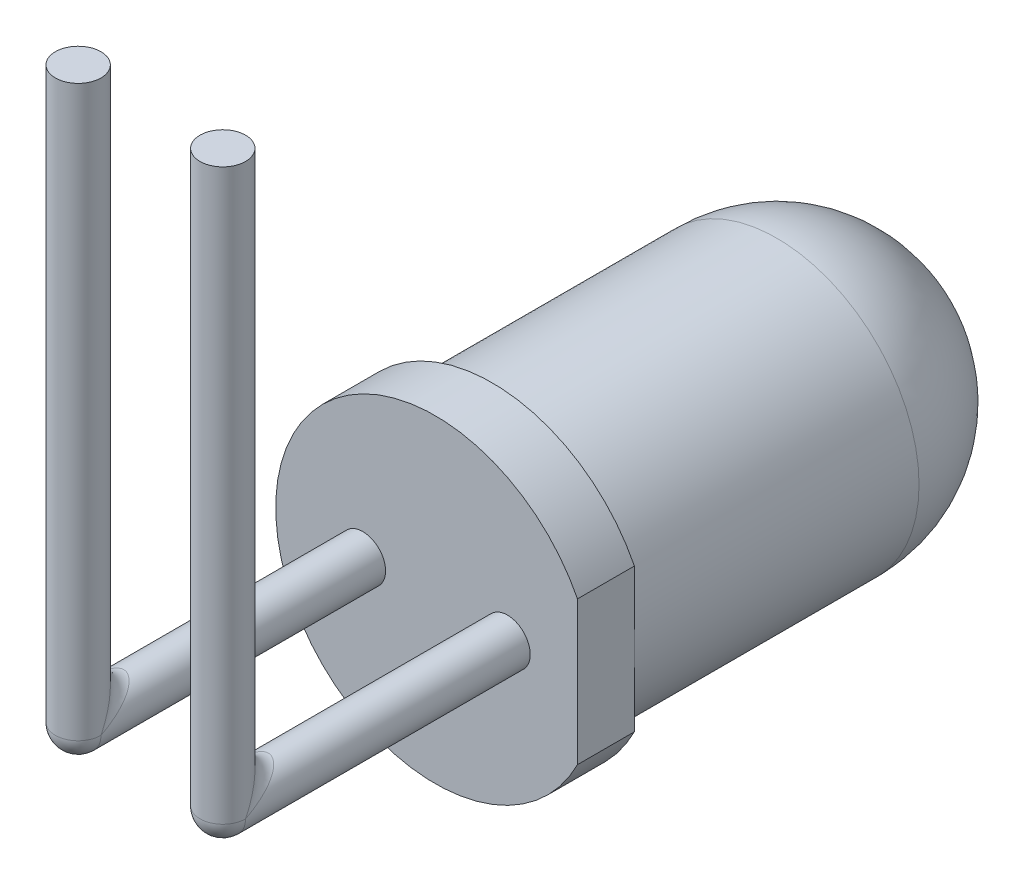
ISO-10303-21;
HEADER;
FILE_DESCRIPTION(('STEP AP214'),'2;1');
FILE_NAME('part.step','',(''),(''),'','','');
FILE_SCHEMA(('AUTOMOTIVE_DESIGN { 1 0 10303 214 1 1 1 1 }'));
ENDSEC;
DATA;
#1=APPLICATION_CONTEXT('core data for automotive mechanical design processes');
#2=APPLICATION_PROTOCOL_DEFINITION('international standard','automotive_design',2000,#1);
#3=PRODUCT_CONTEXT('',#1,'mechanical');
#4=PRODUCT('Part','Part','',(#3));
#5=PRODUCT_RELATED_PRODUCT_CATEGORY('part','',(#4));
#6=PRODUCT_DEFINITION_FORMATION('','',#4);
#7=PRODUCT_DEFINITION_CONTEXT('part definition',#1,'design');
#8=PRODUCT_DEFINITION('design','',#6,#7);
#9=PRODUCT_DEFINITION_SHAPE('','',#8);
#10=(LENGTH_UNIT() NAMED_UNIT(*) SI_UNIT(.MILLI.,.METRE.));
#11=(NAMED_UNIT(*) PLANE_ANGLE_UNIT() SI_UNIT($,.RADIAN.));
#12=(NAMED_UNIT(*) SI_UNIT($,.STERADIAN.) SOLID_ANGLE_UNIT());
#13=UNCERTAINTY_MEASURE_WITH_UNIT(LENGTH_MEASURE(1.E-05),#10,'distance_accuracy_value','');
#14=(GEOMETRIC_REPRESENTATION_CONTEXT(3) GLOBAL_UNCERTAINTY_ASSIGNED_CONTEXT((#13)) GLOBAL_UNIT_ASSIGNED_CONTEXT((#10,
#11,#12)) REPRESENTATION_CONTEXT('',''));
#15=CARTESIAN_POINT('',(0.,0.,0.));
#16=DIRECTION('',(0.,0.,1.));
#17=DIRECTION('',(1.,0.,0.));
#18=AXIS2_PLACEMENT_3D('',#15,#16,#17);
#19=CARTESIAN_POINT('',(0.,0.,8.5));
#20=DIRECTION('',(0.,0.,-1.));
#21=DIRECTION('',(-1.,0.,0.));
#22=AXIS2_PLACEMENT_3D('',#19,#20,#21);
#23=CYLINDRICAL_SURFACE('',#22,2.5);
#24=CARTESIAN_POINT('',(0.,0.,2.5));
#25=DIRECTION('',(0.,0.,-1.));
#26=DIRECTION('',(-1.,0.,0.));
#27=AXIS2_PLACEMENT_3D('',#24,#25,#26);
#28=CIRCLE('',#27,2.5);
#29=CARTESIAN_POINT('',(-2.5,0.,2.5));
#30=VERTEX_POINT('',#29);
#31=EDGE_CURVE('E100',#30,#30,#28,.F.);
#32=ORIENTED_EDGE('',*,*,#31,.T.);
#33=EDGE_LOOP('',(#32));
#34=FACE_BOUND('',#33,.T.);
#35=CARTESIAN_POINT('',(0.,0.,7.5));
#36=DIRECTION('',(0.,0.,1.));
#37=DIRECTION('',(1.,0.,0.));
#38=AXIS2_PLACEMENT_3D('',#35,#36,#37);
#39=CIRCLE('',#38,2.5);
#40=CARTESIAN_POINT('',(2.5,0.,7.5));
#41=VERTEX_POINT('',#40);
#42=EDGE_CURVE('E96',#41,#41,#39,.T.);
#43=ORIENTED_EDGE('',*,*,#42,.F.);
#44=EDGE_LOOP('',(#43));
#45=FACE_BOUND('',#44,.T.);
#46=ADVANCED_FACE('F29',(#34,#45),#23,.T.);
#47=CARTESIAN_POINT('',(0.,0.,7.5));
#48=DIRECTION('',(0.,0.,1.));
#49=DIRECTION('',(1.,0.,0.));
#50=AXIS2_PLACEMENT_3D('',#47,#48,#49);
#51=PLANE('',#50);
#52=DIRECTION('',(0.,1.,0.));
#53=VECTOR('',#52,1.);
#54=CARTESIAN_POINT('',(2.5,1.26095202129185,7.5));
#55=LINE('',#54,#53);
#56=CARTESIAN_POINT('',(2.5,1.26095202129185,7.5));
#57=VERTEX_POINT('',#56);
#58=EDGE_CURVE('E91',#41,#57,#55,.T.);
#59=ORIENTED_EDGE('',*,*,#58,.F.);
#60=ORIENTED_EDGE('',*,*,#42,.T.);
#61=CARTESIAN_POINT('',(2.5,-1.26095202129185,7.5));
#62=VERTEX_POINT('',#61);
#63=EDGE_CURVE('E81',#62,#41,#55,.T.);
#64=ORIENTED_EDGE('',*,*,#63,.F.);
#65=CARTESIAN_POINT('',(0.,0.,7.5));
#66=DIRECTION('',(0.,0.,1.));
#67=DIRECTION('',(1.,0.,0.));
#68=AXIS2_PLACEMENT_3D('',#65,#66,#67);
#69=CIRCLE('',#68,2.8);
#70=EDGE_CURVE('E75',#57,#62,#69,.T.);
#71=ORIENTED_EDGE('',*,*,#70,.F.);
#72=EDGE_LOOP('',(#59,#60,#64,#71));
#73=FACE_BOUND('',#72,.T.);
#74=ADVANCED_FACE('F141',(#73),#51,.F.);
#75=CARTESIAN_POINT('',(2.5,1.26095202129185,7.5));
#76=DIRECTION('',(1.,0.,0.));
#77=DIRECTION('',(0.,0.,-1.));
#78=AXIS2_PLACEMENT_3D('',#75,#76,#77);
#79=PLANE('',#78);
#80=ORIENTED_EDGE('',*,*,#63,.T.);
#81=ORIENTED_EDGE('',*,*,#58,.T.);
#82=DIRECTION('',(0.,0.,1.));
#83=VECTOR('',#82,1.);
#84=CARTESIAN_POINT('',(2.5,1.26095202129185,7.5));
#85=LINE('',#84,#83);
#86=CARTESIAN_POINT('',(2.5,1.26095202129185,8.5));
#87=VERTEX_POINT('',#86);
#88=EDGE_CURVE('E80',#57,#87,#85,.T.);
#89=ORIENTED_EDGE('',*,*,#88,.T.);
#90=DIRECTION('',(0.,1.,0.));
#91=VECTOR('',#90,1.);
#92=CARTESIAN_POINT('',(2.5,1.26095202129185,8.5));
#93=LINE('',#92,#91);
#94=CARTESIAN_POINT('',(2.5,-1.26095202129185,8.5));
#95=VERTEX_POINT('',#94);
#96=EDGE_CURVE('E85',#95,#87,#93,.T.);
#97=ORIENTED_EDGE('',*,*,#96,.F.);
#98=DIRECTION('',(0.,0.,1.));
#99=VECTOR('',#98,1.);
#100=CARTESIAN_POINT('',(2.5,-1.26095202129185,7.5));
#101=LINE('',#100,#99);
#102=EDGE_CURVE('E69',#62,#95,#101,.T.);
#103=ORIENTED_EDGE('',*,*,#102,.F.);
#104=EDGE_LOOP('',(#80,#81,#89,#97,#103));
#105=FACE_BOUND('',#104,.T.);
#106=ADVANCED_FACE('F89',(#105),#79,.T.);
#107=CARTESIAN_POINT('',(0.,0.,7.5));
#108=DIRECTION('',(0.,0.,1.));
#109=DIRECTION('',(1.,0.,0.));
#110=AXIS2_PLACEMENT_3D('',#107,#108,#109);
#111=CYLINDRICAL_SURFACE('',#110,2.8);
#112=CARTESIAN_POINT('',(0.,0.,8.5));
#113=DIRECTION('',(0.,0.,1.));
#114=DIRECTION('',(1.,0.,0.));
#115=AXIS2_PLACEMENT_3D('',#112,#113,#114);
#116=CIRCLE('',#115,2.8);
#117=EDGE_CURVE('E73',#87,#95,#116,.T.);
#118=ORIENTED_EDGE('',*,*,#117,.F.);
#119=ORIENTED_EDGE('',*,*,#88,.F.);
#120=ORIENTED_EDGE('',*,*,#70,.T.);
#121=ORIENTED_EDGE('',*,*,#102,.T.);
#122=EDGE_LOOP('',(#118,#119,#120,#121));
#123=FACE_BOUND('',#122,.T.);
#124=ADVANCED_FACE('F71',(#123),#111,.T.);
#125=CARTESIAN_POINT('',(0.,0.,8.5));
#126=DIRECTION('',(0.,0.,1.));
#127=DIRECTION('',(1.,0.,0.));
#128=AXIS2_PLACEMENT_3D('',#125,#126,#127);
#129=PLANE('',#128);
#130=CARTESIAN_POINT('',(-1.27,0.,8.5));
#131=DIRECTION('',(0.,0.,1.));
#132=DIRECTION('',(1.,0.,0.));
#133=AXIS2_PLACEMENT_3D('',#130,#131,#132);
#134=CIRCLE('',#133,0.4);
#135=CARTESIAN_POINT('',(-0.87,0.,8.5));
#136=VERTEX_POINT('',#135);
#137=EDGE_CURVE('E108',#136,#136,#134,.T.);
#138=ORIENTED_EDGE('',*,*,#137,.F.);
#139=EDGE_LOOP('',(#138));
#140=FACE_BOUND('',#139,.T.);
#141=CARTESIAN_POINT('',(1.27,0.,8.5));
#142=DIRECTION('',(0.,0.,1.));
#143=DIRECTION('',(1.,0.,0.));
#144=AXIS2_PLACEMENT_3D('',#141,#142,#143);
#145=CIRCLE('',#144,0.4);
#146=CARTESIAN_POINT('',(1.67,0.,8.5));
#147=VERTEX_POINT('',#146);
#148=EDGE_CURVE('E103',#147,#147,#145,.T.);
#149=ORIENTED_EDGE('',*,*,#148,.F.);
#150=EDGE_LOOP('',(#149));
#151=FACE_BOUND('',#150,.T.);
#152=ORIENTED_EDGE('',*,*,#96,.T.);
#153=ORIENTED_EDGE('',*,*,#117,.T.);
#154=EDGE_LOOP('',(#152,#153));
#155=FACE_BOUND('',#154,.T.);
#156=ADVANCED_FACE('F84',(#140,#151,#155),#129,.T.);
#157=CARTESIAN_POINT('',(0.,0.,2.5));
#158=DIRECTION('',(0.,0.,1.));
#159=DIRECTION('',(1.,0.,0.));
#160=AXIS2_PLACEMENT_3D('',#157,#158,#159);
#161=SPHERICAL_SURFACE('',#160,2.5);
#162=ORIENTED_EDGE('',*,*,#31,.F.);
#163=EDGE_LOOP('',(#162));
#164=FACE_BOUND('',#163,.T.);
#165=ADVANCED_FACE('F154',(#164),#161,.T.);
#166=CARTESIAN_POINT('',(1.27,0.,13.5));
#167=DIRECTION('',(0.,1.,0.));
#168=DIRECTION('',(0.,0.,1.));
#169=AXIS2_PLACEMENT_3D('',#166,#167,#168);
#170=CYLINDRICAL_SURFACE('',#169,0.4);
#171=CARTESIAN_POINT('',(1.27,0.,13.5));
#172=DIRECTION('',(0.,-0.447213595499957,-0.894427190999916));
#173=DIRECTION('',(0.,0.894427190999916,-0.447213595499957));
#174=AXIS2_PLACEMENT_3D('',#171,#172,#173);
#175=ELLIPSE('',#174,0.894427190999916,0.4);
#176=CARTESIAN_POINT('',(1.67,0.,13.5));
#177=VERTEX_POINT('',#176);
#178=CARTESIAN_POINT('',(0.87,0.,13.5));
#179=VERTEX_POINT('',#178);
#180=EDGE_CURVE('E104',#177,#179,#175,.F.);
#181=ORIENTED_EDGE('',*,*,#180,.T.);
#182=CARTESIAN_POINT('',(1.27,0.,13.5));
#183=DIRECTION('',(0.,1.,0.));
#184=DIRECTION('',(0.,0.,1.));
#185=AXIS2_PLACEMENT_3D('',#182,#183,#184);
#186=CIRCLE('',#185,0.4);
#187=EDGE_CURVE('E107',#179,#177,#186,.T.);
#188=ORIENTED_EDGE('',*,*,#187,.T.);
#189=EDGE_LOOP('',(#181,#188));
#190=FACE_BOUND('',#189,.T.);
#191=CARTESIAN_POINT('',(1.27,10.,13.5));
#192=DIRECTION('',(0.,1.,0.));
#193=DIRECTION('',(0.,0.,1.));
#194=AXIS2_PLACEMENT_3D('',#191,#192,#193);
#195=CIRCLE('',#194,0.4);
#196=CARTESIAN_POINT('',(1.27,10.,13.9));
#197=VERTEX_POINT('',#196);
#198=EDGE_CURVE('E87',#197,#197,#195,.F.);
#199=ORIENTED_EDGE('',*,*,#198,.T.);
#200=EDGE_LOOP('',(#199));
#201=FACE_BOUND('',#200,.T.);
#202=ADVANCED_FACE('F155',(#190,#201),#170,.T.);
#203=CARTESIAN_POINT('',(1.27,0.,14.6313708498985));
#204=DIRECTION('',(0.,0.,-1.));
#205=DIRECTION('',(0.,1.,0.));
#206=AXIS2_PLACEMENT_3D('',#203,#204,#205);
#207=CYLINDRICAL_SURFACE('',#206,0.4);
#208=ORIENTED_EDGE('',*,*,#148,.T.);
#209=EDGE_LOOP('',(#208));
#210=FACE_BOUND('',#209,.T.);
#211=CARTESIAN_POINT('',(1.27,0.,13.5));
#212=DIRECTION('',(0.,0.,-1.));
#213=DIRECTION('',(0.,1.,0.));
#214=AXIS2_PLACEMENT_3D('',#211,#212,#213);
#215=CIRCLE('',#214,0.4);
#216=EDGE_CURVE('E111',#177,#179,#215,.T.);
#217=ORIENTED_EDGE('',*,*,#216,.T.);
#218=CARTESIAN_POINT('',(1.27,0.,13.5));
#219=DIRECTION('',(0.,-0.894427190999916,-0.447213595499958));
#220=DIRECTION('',(0.,0.447213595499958,-0.894427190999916));
#221=AXIS2_PLACEMENT_3D('',#218,#219,#220);
#222=ELLIPSE('',#221,0.894427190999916,0.4);
#223=EDGE_CURVE('E114',#179,#177,#222,.T.);
#224=ORIENTED_EDGE('',*,*,#223,.T.);
#225=EDGE_LOOP('',(#217,#224));
#226=FACE_BOUND('',#225,.T.);
#227=ADVANCED_FACE('F161',(#210,#226),#207,.T.);
#228=CARTESIAN_POINT('',(1.27,10.,13.5));
#229=DIRECTION('',(0.,1.,0.));
#230=DIRECTION('',(0.,0.,1.));
#231=AXIS2_PLACEMENT_3D('',#228,#229,#230);
#232=PLANE('',#231);
#233=ORIENTED_EDGE('',*,*,#198,.F.);
#234=EDGE_LOOP('',(#233));
#235=FACE_BOUND('',#234,.T.);
#236=ADVANCED_FACE('F204',(#235),#232,.T.);
#237=CARTESIAN_POINT('',(-1.27,0.,13.5));
#238=DIRECTION('',(0.,1.,0.));
#239=DIRECTION('',(0.,0.,1.));
#240=AXIS2_PLACEMENT_3D('',#237,#238,#239);
#241=CYLINDRICAL_SURFACE('',#240,0.4);
#242=CARTESIAN_POINT('',(-1.27,0.,13.5));
#243=DIRECTION('',(0.,-0.447213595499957,-0.894427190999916));
#244=DIRECTION('',(0.,0.894427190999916,-0.447213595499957));
#245=AXIS2_PLACEMENT_3D('',#242,#243,#244);
#246=ELLIPSE('',#245,0.894427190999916,0.4);
#247=CARTESIAN_POINT('',(-0.87,0.,13.5));
#248=VERTEX_POINT('',#247);
#249=CARTESIAN_POINT('',(-1.67,0.,13.5));
#250=VERTEX_POINT('',#249);
#251=EDGE_CURVE('E117',#248,#250,#246,.F.);
#252=ORIENTED_EDGE('',*,*,#251,.T.);
#253=CARTESIAN_POINT('',(-1.27,0.,13.5));
#254=DIRECTION('',(0.,1.,0.));
#255=DIRECTION('',(0.,0.,1.));
#256=AXIS2_PLACEMENT_3D('',#253,#254,#255);
#257=CIRCLE('',#256,0.4);
#258=EDGE_CURVE('E120',#250,#248,#257,.T.);
#259=ORIENTED_EDGE('',*,*,#258,.T.);
#260=EDGE_LOOP('',(#252,#259));
#261=FACE_BOUND('',#260,.T.);
#262=CARTESIAN_POINT('',(-1.27,10.,13.5));
#263=DIRECTION('',(0.,1.,0.));
#264=DIRECTION('',(0.,0.,1.));
#265=AXIS2_PLACEMENT_3D('',#262,#263,#264);
#266=CIRCLE('',#265,0.4);
#267=CARTESIAN_POINT('',(-1.27,10.,13.9));
#268=VERTEX_POINT('',#267);
#269=EDGE_CURVE('E263',#268,#268,#266,.F.);
#270=ORIENTED_EDGE('',*,*,#269,.T.);
#271=EDGE_LOOP('',(#270));
#272=FACE_BOUND('',#271,.T.);
#273=ADVANCED_FACE('F125',(#261,#272),#241,.T.);
#274=CARTESIAN_POINT('',(-1.27,0.,14.6313708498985));
#275=DIRECTION('',(0.,0.,-1.));
#276=DIRECTION('',(0.,1.,0.));
#277=AXIS2_PLACEMENT_3D('',#274,#275,#276);
#278=CYLINDRICAL_SURFACE('',#277,0.4);
#279=ORIENTED_EDGE('',*,*,#137,.T.);
#280=EDGE_LOOP('',(#279));
#281=FACE_BOUND('',#280,.T.);
#282=CARTESIAN_POINT('',(-1.27,0.,13.5));
#283=DIRECTION('',(0.,0.,-1.));
#284=DIRECTION('',(0.,1.,0.));
#285=AXIS2_PLACEMENT_3D('',#282,#283,#284);
#286=CIRCLE('',#285,0.4);
#287=EDGE_CURVE('E36',#248,#250,#286,.T.);
#288=ORIENTED_EDGE('',*,*,#287,.T.);
#289=CARTESIAN_POINT('',(-1.27,0.,13.5));
#290=DIRECTION('',(0.,-0.894427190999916,-0.447213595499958));
#291=DIRECTION('',(0.,0.447213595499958,-0.894427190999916));
#292=AXIS2_PLACEMENT_3D('',#289,#290,#291);
#293=ELLIPSE('',#292,0.894427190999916,0.4);
#294=EDGE_CURVE('E12',#250,#248,#293,.T.);
#295=ORIENTED_EDGE('',*,*,#294,.T.);
#296=EDGE_LOOP('',(#288,#295));
#297=FACE_BOUND('',#296,.T.);
#298=ADVANCED_FACE('F123',(#281,#297),#278,.T.);
#299=CARTESIAN_POINT('',(-1.27,10.,13.5));
#300=DIRECTION('',(0.,1.,0.));
#301=DIRECTION('',(0.,0.,1.));
#302=AXIS2_PLACEMENT_3D('',#299,#300,#301);
#303=PLANE('',#302);
#304=ORIENTED_EDGE('',*,*,#269,.F.);
#305=EDGE_LOOP('',(#304));
#306=FACE_BOUND('',#305,.T.);
#307=ADVANCED_FACE('F223',(#306),#303,.T.);
#308=CARTESIAN_POINT('',(1.27,0.,13.5));
#309=DIRECTION('',(0.,0.,1.));
#310=DIRECTION('',(1.,0.,0.));
#311=AXIS2_PLACEMENT_3D('',#308,#309,#310);
#312=SPHERICAL_SURFACE('',#311,0.4);
#313=ORIENTED_EDGE('',*,*,#187,.F.);
#314=ORIENTED_EDGE('',*,*,#216,.F.);
#315=EDGE_LOOP('',(#313,#314));
#316=FACE_BOUND('',#315,.T.);
#317=ADVANCED_FACE('F137',(#316),#312,.T.);
#318=CARTESIAN_POINT('',(1.67,0.,13.5));
#319=CARTESIAN_POINT('',(1.67,0.,13.5));
#320=CARTESIAN_POINT('',(1.67,0.,13.5));
#321=CARTESIAN_POINT('',(1.66999298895,0.0348517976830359,13.4825741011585));
#322=CARTESIAN_POINT('',(1.67005108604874,0.0261441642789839,13.473855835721));
#323=CARTESIAN_POINT('',(1.66999298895,0.0174258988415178,13.465148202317));
#324=CARTESIAN_POINT('',(1.66886070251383,0.0697124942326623,13.4651437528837));
#325=CARTESIAN_POINT('',(1.66772093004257,0.0523600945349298,13.4476399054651));
#326=CARTESIAN_POINT('',(1.66886070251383,0.034856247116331,13.4302875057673));
#327=CARTESIAN_POINT('',(1.66431458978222,0.138834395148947,13.4305828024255));
#328=CARTESIAN_POINT('',(1.65863330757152,0.103749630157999,13.396250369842));
#329=CARTESIAN_POINT('',(1.66431458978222,0.0694171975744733,13.3611656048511));
#330=CARTESIAN_POINT('',(1.66092023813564,0.173098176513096,13.4134509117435));
#331=CARTESIAN_POINT('',(1.65186272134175,0.129071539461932,13.3709284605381));
#332=CARTESIAN_POINT('',(1.66092023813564,0.0865490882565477,13.3269018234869));
#333=CARTESIAN_POINT('',(1.65189673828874,0.24044273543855,13.3797786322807));
#334=CARTESIAN_POINT('',(1.63414910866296,0.177786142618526,13.3222138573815));
#335=CARTESIAN_POINT('',(1.65189673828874,0.120221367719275,13.2595572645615));
#336=CARTESIAN_POINT('',(1.6463060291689,0.273533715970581,13.3632331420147));
#337=CARTESIAN_POINT('',(1.62318021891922,0.201325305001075,13.2986746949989));
#338=CARTESIAN_POINT('',(1.6463060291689,0.136766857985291,13.2264662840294));
#339=CARTESIAN_POINT('',(1.63296398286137,0.337956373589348,13.3310218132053));
#340=CARTESIAN_POINT('',(1.59763412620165,0.245616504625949,13.2543834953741));
#341=CARTESIAN_POINT('',(1.63296398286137,0.168978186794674,13.1620436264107));
#342=CARTESIAN_POINT('',(1.62526926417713,0.369311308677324,13.3153443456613));
#343=CARTESIAN_POINT('',(1.58301825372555,0.266510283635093,13.2334897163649));
#344=CARTESIAN_POINT('',(1.62526926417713,0.184655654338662,13.1306886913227));
#345=CARTESIAN_POINT('',(1.60783304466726,0.42971186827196,13.285144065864));
#346=CARTESIAN_POINT('',(1.55100028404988,0.304712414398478,13.1952875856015));
#347=CARTESIAN_POINT('',(1.60783304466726,0.21485593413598,13.070288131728));
#348=CARTESIAN_POINT('',(1.59816448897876,0.458799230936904,13.2706003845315));
#349=CARTESIAN_POINT('',(1.53354818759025,0.322154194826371,13.1778458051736));
#350=CARTESIAN_POINT('',(1.59816448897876,0.229399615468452,13.0412007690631));
#351=CARTESIAN_POINT('',(1.57692939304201,0.514147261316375,13.2429263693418));
#352=CARTESIAN_POINT('',(1.49701863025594,0.352779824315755,13.1472201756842));
#353=CARTESIAN_POINT('',(1.57692939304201,0.257073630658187,12.9858527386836));
#354=CARTESIAN_POINT('',(1.56544892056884,0.540473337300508,13.2297633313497));
#355=CARTESIAN_POINT('',(1.47788315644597,0.366083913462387,13.1339160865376));
#356=CARTESIAN_POINT('',(1.56544892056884,0.270236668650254,12.9595266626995));
#357=CARTESIAN_POINT('',(1.54077355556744,0.589823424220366,13.2050882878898));
#358=CARTESIAN_POINT('',(1.43951787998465,0.388004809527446,13.1119951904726));
#359=CARTESIAN_POINT('',(1.54077355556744,0.294911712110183,12.9101765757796));
#360=CARTESIAN_POINT('',(1.52767253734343,0.612940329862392,13.1935298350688));
#361=CARTESIAN_POINT('',(1.42022816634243,0.396723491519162,13.1032765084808));
#362=CARTESIAN_POINT('',(1.52767253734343,0.306470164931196,12.8870596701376));
#363=CARTESIAN_POINT('',(1.49997342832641,0.655447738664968,13.1722761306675));
#364=CARTESIAN_POINT('',(1.38341468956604,0.409472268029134,13.0905277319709));
#365=CARTESIAN_POINT('',(1.49997342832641,0.327723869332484,12.844552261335));
#366=CARTESIAN_POINT('',(1.48546909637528,0.674959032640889,13.1625204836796));
#367=CARTESIAN_POINT('',(1.36583761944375,0.413582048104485,13.0864179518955));
#368=CARTESIAN_POINT('',(1.48546909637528,0.337479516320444,12.8250409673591));
#369=CARTESIAN_POINT('',(1.45521408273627,0.709892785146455,13.1450536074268));
#370=CARTESIAN_POINT('',(1.33439698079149,0.417771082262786,13.0822289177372));
#371=CARTESIAN_POINT('',(1.45521408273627,0.354946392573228,12.7901072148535));
#372=CARTESIAN_POINT('',(1.43954673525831,0.725457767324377,13.1372711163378));
#373=CARTESIAN_POINT('',(1.32049509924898,0.417907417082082,13.0820925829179));
#374=CARTESIAN_POINT('',(1.43954673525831,0.362728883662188,12.7745422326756));
#375=CARTESIAN_POINT('',(1.40724861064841,0.752212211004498,13.1238938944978));
#376=CARTESIAN_POINT('',(1.2978686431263,0.415624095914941,13.0843759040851));
#377=CARTESIAN_POINT('',(1.40724861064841,0.376106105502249,12.7477877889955));
#378=CARTESIAN_POINT('',(1.39068005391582,0.763549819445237,13.1182250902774));
#379=CARTESIAN_POINT('',(1.28912434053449,0.413242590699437,13.0867574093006));
#380=CARTESIAN_POINT('',(1.39068005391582,0.381774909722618,12.7364501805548));
#381=CARTESIAN_POINT('',(1.35689020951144,0.781655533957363,13.1091722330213));
#382=CARTESIAN_POINT('',(1.2769352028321,0.40803809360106,13.0919619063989));
#383=CARTESIAN_POINT('',(1.35689020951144,0.390827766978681,12.7183444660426));
#384=CARTESIAN_POINT('',(1.33970345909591,0.788550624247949,13.105724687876));
#385=CARTESIAN_POINT('',(1.27348474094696,0.405239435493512,13.0947605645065));
#386=CARTESIAN_POINT('',(1.33970345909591,0.394275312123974,12.7114493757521));
#387=CARTESIAN_POINT('',(1.30500449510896,0.797685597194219,13.1011572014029));
#388=CARTESIAN_POINT('',(1.27002308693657,0.401214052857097,13.0987859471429));
#389=CARTESIAN_POINT('',(1.30500449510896,0.398842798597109,12.7023144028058));
#390=CARTESIAN_POINT('',(1.28750224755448,0.8,13.1));
#391=CARTESIAN_POINT('',(1.27001157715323,0.4,13.1));
#392=CARTESIAN_POINT('',(1.28750224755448,0.4,12.7));
#393=CARTESIAN_POINT('',(1.25249775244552,0.8,13.1));
#394=CARTESIAN_POINT('',(1.26998842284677,0.4,13.1));
#395=CARTESIAN_POINT('',(1.25249775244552,0.4,12.7));
#396=CARTESIAN_POINT('',(1.23499550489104,0.797685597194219,13.1011572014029));
#397=CARTESIAN_POINT('',(1.26997691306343,0.401214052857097,13.0987859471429));
#398=CARTESIAN_POINT('',(1.23499550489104,0.398842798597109,12.7023144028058));
#399=CARTESIAN_POINT('',(1.20029654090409,0.788550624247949,13.105724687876));
#400=CARTESIAN_POINT('',(1.26651525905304,0.405239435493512,13.0947605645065));
#401=CARTESIAN_POINT('',(1.20029654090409,0.394275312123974,12.7114493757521));
#402=CARTESIAN_POINT('',(1.18310979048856,0.781655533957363,13.1091722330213));
#403=CARTESIAN_POINT('',(1.2630647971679,0.40803809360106,13.0919619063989));
#404=CARTESIAN_POINT('',(1.18310979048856,0.390827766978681,12.7183444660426));
#405=CARTESIAN_POINT('',(1.14931994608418,0.763549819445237,13.1182250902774));
#406=CARTESIAN_POINT('',(1.25087565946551,0.413242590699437,13.0867574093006));
#407=CARTESIAN_POINT('',(1.14931994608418,0.381774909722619,12.7364501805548));
#408=CARTESIAN_POINT('',(1.13275138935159,0.752212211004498,13.1238938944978));
#409=CARTESIAN_POINT('',(1.2421313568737,0.415624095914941,13.0843759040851));
#410=CARTESIAN_POINT('',(1.13275138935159,0.376106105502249,12.7477877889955));
#411=CARTESIAN_POINT('',(1.10045326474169,0.725457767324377,13.1372711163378));
#412=CARTESIAN_POINT('',(1.21950490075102,0.417907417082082,13.0820925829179));
#413=CARTESIAN_POINT('',(1.10045326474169,0.362728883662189,12.7745422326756));
#414=CARTESIAN_POINT('',(1.08478591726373,0.709892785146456,13.1450536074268));
#415=CARTESIAN_POINT('',(1.20560301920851,0.417771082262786,13.0822289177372));
#416=CARTESIAN_POINT('',(1.08478591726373,0.354946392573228,12.7901072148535));
#417=CARTESIAN_POINT('',(1.05453090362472,0.67495903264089,13.1625204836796));
#418=CARTESIAN_POINT('',(1.17416238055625,0.413582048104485,13.0864179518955));
#419=CARTESIAN_POINT('',(1.05453090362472,0.337479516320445,12.8250409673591));
#420=CARTESIAN_POINT('',(1.04002657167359,0.655447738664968,13.1722761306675));
#421=CARTESIAN_POINT('',(1.15658531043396,0.409472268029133,13.0905277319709));
#422=CARTESIAN_POINT('',(1.04002657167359,0.327723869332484,12.844552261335));
#423=CARTESIAN_POINT('',(1.01232746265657,0.612940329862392,13.1935298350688));
#424=CARTESIAN_POINT('',(1.11977183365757,0.396723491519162,13.1032765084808));
#425=CARTESIAN_POINT('',(1.01232746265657,0.306470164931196,12.8870596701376));
#426=CARTESIAN_POINT('',(0.999226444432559,0.589823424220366,13.2050882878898));
#427=CARTESIAN_POINT('',(1.10048212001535,0.388004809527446,13.1119951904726));
#428=CARTESIAN_POINT('',(0.999226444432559,0.294911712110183,12.9101765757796));
#429=CARTESIAN_POINT('',(0.974551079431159,0.540473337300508,13.2297633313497));
#430=CARTESIAN_POINT('',(1.06211684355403,0.366083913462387,13.1339160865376));
#431=CARTESIAN_POINT('',(0.974551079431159,0.270236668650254,12.9595266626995));
#432=CARTESIAN_POINT('',(0.963070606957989,0.514147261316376,13.2429263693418));
#433=CARTESIAN_POINT('',(1.04298136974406,0.352779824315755,13.1472201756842));
#434=CARTESIAN_POINT('',(0.963070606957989,0.257073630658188,12.9858527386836));
#435=CARTESIAN_POINT('',(0.941835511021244,0.458799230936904,13.2706003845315));
#436=CARTESIAN_POINT('',(1.00645181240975,0.322154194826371,13.1778458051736));
#437=CARTESIAN_POINT('',(0.941835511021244,0.229399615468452,13.0412007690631));
#438=CARTESIAN_POINT('',(0.932166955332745,0.42971186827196,13.285144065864));
#439=CARTESIAN_POINT('',(0.988999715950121,0.304712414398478,13.1952875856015));
#440=CARTESIAN_POINT('',(0.932166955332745,0.21485593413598,13.070288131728));
#441=CARTESIAN_POINT('',(0.91473073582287,0.369311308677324,13.3153443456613));
#442=CARTESIAN_POINT('',(0.956981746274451,0.266510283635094,13.2334897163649));
#443=CARTESIAN_POINT('',(0.91473073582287,0.184655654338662,13.1306886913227));
#444=CARTESIAN_POINT('',(0.907036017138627,0.337956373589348,13.3310218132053));
#445=CARTESIAN_POINT('',(0.942365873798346,0.245616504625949,13.2543834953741));
#446=CARTESIAN_POINT('',(0.907036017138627,0.168978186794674,13.1620436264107));
#447=CARTESIAN_POINT('',(0.893693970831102,0.273533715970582,13.3632331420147));
#448=CARTESIAN_POINT('',(0.916819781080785,0.201325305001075,13.2986746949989));
#449=CARTESIAN_POINT('',(0.893693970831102,0.136766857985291,13.2264662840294));
#450=CARTESIAN_POINT('',(0.888103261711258,0.240442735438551,13.3797786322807));
#451=CARTESIAN_POINT('',(0.905850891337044,0.177786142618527,13.3222138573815));
#452=CARTESIAN_POINT('',(0.888103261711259,0.120221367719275,13.2595572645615));
#453=CARTESIAN_POINT('',(0.879079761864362,0.173098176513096,13.4134509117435));
#454=CARTESIAN_POINT('',(0.888137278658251,0.129071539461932,13.3709284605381));
#455=CARTESIAN_POINT('',(0.879079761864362,0.086549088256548,13.3269018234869));
#456=CARTESIAN_POINT('',(0.87568541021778,0.138834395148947,13.4305828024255));
#457=CARTESIAN_POINT('',(0.881366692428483,0.103749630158,13.396250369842));
#458=CARTESIAN_POINT('',(0.87568541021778,0.0694171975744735,13.3611656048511));
#459=CARTESIAN_POINT('',(0.871139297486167,0.0697124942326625,13.4651437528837));
#460=CARTESIAN_POINT('',(0.872279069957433,0.05236009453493,13.4476399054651));
#461=CARTESIAN_POINT('',(0.871139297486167,0.0348562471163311,13.4302875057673));
#462=CARTESIAN_POINT('',(0.870007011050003,0.034851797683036,13.4825741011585));
#463=CARTESIAN_POINT('',(0.869948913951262,0.026144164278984,13.473855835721));
#464=CARTESIAN_POINT('',(0.870007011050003,0.0174258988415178,13.465148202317));
#465=CARTESIAN_POINT('',(0.87,0.,13.5));
#466=CARTESIAN_POINT('',(0.87,0.,13.5));
#467=CARTESIAN_POINT('',(0.87,0.,13.5));
#468=(BOUNDED_SURFACE() B_SPLINE_SURFACE(3,2,((#318,#319,#320),(#321,#322,#323),(#324,#325,
#326),(#327,#328,#329),(#330,#331,#332),(#333,#334,#335),(#336,#337,#338),(#339,#340,#341),
(#342,#343,#344),(#345,#346,#347),(#348,#349,#350),(#351,#352,#353),(#354,#355,#356),(#357,#358,
#359),(#360,#361,#362),(#363,#364,#365),(#366,#367,#368),(#369,#370,#371),(#372,#373,#374),
(#375,#376,#377),(#378,#379,#380),(#381,#382,#383),(#384,#385,#386),(#387,#388,#389),(#390,#391,
#392),(#393,#394,#395),(#396,#397,#398),(#399,#400,#401),(#402,#403,#404),(#405,#406,#407),
(#408,#409,#410),(#411,#412,#413),(#414,#415,#416),(#417,#418,#419),(#420,#421,#422),(#423,#424,
#425),(#426,#427,#428),(#429,#430,#431),(#432,#433,#434),(#435,#436,#437),(#438,#439,#440),
(#441,#442,#443),(#444,#445,#446),(#447,#448,#449),(#450,#451,#452),(#453,#454,#455),(#456,#457,
#458),(#459,#460,#461),(#462,#463,#464),(#465,#466,#467)),.UNSPECIFIED.,.F.,.F.,
.F.) B_SPLINE_SURFACE_WITH_KNOTS((4,2,2,2,2,2,2,2,2,2,2,2,2,2,2,2,2,2,2,2,2,2,2,2,4),(3,3),(0.,
0.147832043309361,0.294407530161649,0.438524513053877,0.579091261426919,0.715183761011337,
0.846105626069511,0.971449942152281,1.09116027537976,1.2055837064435,1.31550198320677,
1.42211980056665,1.52698838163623,1.63185696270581,1.73847478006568,1.84839305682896,
1.9628164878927,2.08252682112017,2.20787113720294,2.33879300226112,2.47488550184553,
2.61545225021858,2.7595692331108,2.90614471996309,3.05397676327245),(0.,1.),
.UNSPECIFIED.) GEOMETRIC_REPRESENTATION_ITEM() RATIONAL_B_SPLINE_SURFACE(((1.,1.,1.),(1.,
1.00000566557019,1.),(1.,0.998576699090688,1.),(1.,0.992910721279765,1.),(1.,0.988697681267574,
1.),(1.,0.97761712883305,1.),(1.,0.970795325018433,1.),(1.,0.954789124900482,1.),(1.,
0.945667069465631,1.),(1.,0.92548796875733,1.),(1.,0.914501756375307,1.),(1.,0.891169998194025,
1.),(1.,0.878891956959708,1.),(1.,0.853706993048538,1.),(1.,0.840849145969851,1.),(1.,
0.815387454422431,1.),(1.,0.802798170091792,1.),(1.,0.778880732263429,1.),(1.,0.767521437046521,
1.),(1.,0.747118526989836,1.),(1.,0.738001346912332,1.),(1.,0.723039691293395,1.),(1.,
0.717105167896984,1.),(1.,0.709170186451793,1.),(1.,0.707106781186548,1.),(1.,0.707106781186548,
1.),(1.,0.709170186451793,1.),(1.,0.717105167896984,1.),(1.,0.723039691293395,1.),(1.,
0.738001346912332,1.),(1.,0.747118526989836,1.),(1.,0.767521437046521,1.),(1.,0.778880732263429,
1.),(1.,0.802798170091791,1.),(1.,0.815387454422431,1.),(1.,0.84084914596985,1.),(1.,
0.853706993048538,1.),(1.,0.878891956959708,1.),(1.,0.891169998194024,1.),(1.,0.914501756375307,
1.),(1.,0.92548796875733,1.),(1.,0.945667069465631,1.),(1.,0.954789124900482,1.),(1.,
0.970795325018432,1.),(1.,0.977617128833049,1.),(1.,0.988697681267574,1.),(1.,0.992910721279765,
1.),(1.,0.998576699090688,1.),(1.,1.00000566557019,1.),(1.,1.,1.))) REPRESENTATION_ITEM('') SURFACE());
#469=ORIENTED_EDGE('',*,*,#180,.F.);
#470=ORIENTED_EDGE('',*,*,#223,.F.);
#471=EDGE_LOOP('',(#469,#470));
#472=FACE_BOUND('',#471,.T.);
#473=ADVANCED_FACE('F130',(#472),#468,.F.);
#474=CARTESIAN_POINT('',(-1.27,0.,13.5));
#475=DIRECTION('',(0.,0.,1.));
#476=DIRECTION('',(1.,0.,0.));
#477=AXIS2_PLACEMENT_3D('',#474,#475,#476);
#478=SPHERICAL_SURFACE('',#477,0.4);
#479=ORIENTED_EDGE('',*,*,#258,.F.);
#480=ORIENTED_EDGE('',*,*,#287,.F.);
#481=EDGE_LOOP('',(#479,#480));
#482=FACE_BOUND('',#481,.T.);
#483=ADVANCED_FACE('F127',(#482),#478,.T.);
#484=CARTESIAN_POINT('',(-0.87,0.,13.5));
#485=CARTESIAN_POINT('',(-0.87,0.,13.5));
#486=CARTESIAN_POINT('',(-0.87,0.,13.5));
#487=CARTESIAN_POINT('',(-0.870007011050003,0.0348517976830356,13.4825741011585));
#488=CARTESIAN_POINT('',(-0.869948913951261,0.0261441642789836,13.473855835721));
#489=CARTESIAN_POINT('',(-0.870007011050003,0.0174258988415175,13.465148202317));
#490=CARTESIAN_POINT('',(-0.871139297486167,0.0697124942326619,13.4651437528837));
#491=CARTESIAN_POINT('',(-0.872279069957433,0.0523600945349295,13.4476399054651));
#492=CARTESIAN_POINT('',(-0.871139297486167,0.0348562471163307,13.4302875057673));
#493=CARTESIAN_POINT('',(-0.87568541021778,0.138834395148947,13.4305828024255));
#494=CARTESIAN_POINT('',(-0.881366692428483,0.103749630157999,13.396250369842));
#495=CARTESIAN_POINT('',(-0.875685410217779,0.069417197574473,13.3611656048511));
#496=CARTESIAN_POINT('',(-0.879079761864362,0.173098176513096,13.4134509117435));
#497=CARTESIAN_POINT('',(-0.88813727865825,0.129071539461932,13.3709284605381));
#498=CARTESIAN_POINT('',(-0.879079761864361,0.0865490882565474,13.3269018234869));
#499=CARTESIAN_POINT('',(-0.888103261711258,0.24044273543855,13.3797786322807));
#500=CARTESIAN_POINT('',(-0.905850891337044,0.177786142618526,13.3222138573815));
#501=CARTESIAN_POINT('',(-0.888103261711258,0.120221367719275,13.2595572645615));
#502=CARTESIAN_POINT('',(-0.893693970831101,0.273533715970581,13.3632331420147));
#503=CARTESIAN_POINT('',(-0.916819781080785,0.201325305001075,13.2986746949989));
#504=CARTESIAN_POINT('',(-0.893693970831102,0.13676685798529,13.2264662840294));
#505=CARTESIAN_POINT('',(-0.907036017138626,0.337956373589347,13.3310218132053));
#506=CARTESIAN_POINT('',(-0.942365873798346,0.245616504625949,13.2543834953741));
#507=CARTESIAN_POINT('',(-0.907036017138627,0.168978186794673,13.1620436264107));
#508=CARTESIAN_POINT('',(-0.914730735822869,0.369311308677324,13.3153443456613));
#509=CARTESIAN_POINT('',(-0.956981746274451,0.266510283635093,13.2334897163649));
#510=CARTESIAN_POINT('',(-0.914730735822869,0.184655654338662,13.1306886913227));
#511=CARTESIAN_POINT('',(-0.932166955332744,0.429711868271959,13.285144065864));
#512=CARTESIAN_POINT('',(-0.98899971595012,0.304712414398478,13.1952875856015));
#513=CARTESIAN_POINT('',(-0.932166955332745,0.214855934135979,13.070288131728));
#514=CARTESIAN_POINT('',(-0.941835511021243,0.458799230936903,13.2706003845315));
#515=CARTESIAN_POINT('',(-1.00645181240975,0.32215419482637,13.1778458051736));
#516=CARTESIAN_POINT('',(-0.941835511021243,0.229399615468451,13.0412007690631));
#517=CARTESIAN_POINT('',(-0.963070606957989,0.514147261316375,13.2429263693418));
#518=CARTESIAN_POINT('',(-1.04298136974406,0.352779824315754,13.1472201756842));
#519=CARTESIAN_POINT('',(-0.963070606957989,0.257073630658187,12.9858527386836));
#520=CARTESIAN_POINT('',(-0.974551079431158,0.540473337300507,13.2297633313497));
#521=CARTESIAN_POINT('',(-1.06211684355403,0.366083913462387,13.1339160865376));
#522=CARTESIAN_POINT('',(-0.974551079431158,0.270236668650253,12.9595266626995));
#523=CARTESIAN_POINT('',(-0.999226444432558,0.589823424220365,13.2050882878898));
#524=CARTESIAN_POINT('',(-1.10048212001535,0.388004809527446,13.1119951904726));
#525=CARTESIAN_POINT('',(-0.999226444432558,0.294911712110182,12.9101765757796));
#526=CARTESIAN_POINT('',(-1.01232746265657,0.612940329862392,13.1935298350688));
#527=CARTESIAN_POINT('',(-1.11977183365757,0.396723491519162,13.1032765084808));
#528=CARTESIAN_POINT('',(-1.01232746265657,0.306470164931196,12.8870596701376));
#529=CARTESIAN_POINT('',(-1.04002657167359,0.655447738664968,13.1722761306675));
#530=CARTESIAN_POINT('',(-1.15658531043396,0.409472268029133,13.0905277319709));
#531=CARTESIAN_POINT('',(-1.04002657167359,0.327723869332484,12.844552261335));
#532=CARTESIAN_POINT('',(-1.05453090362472,0.674959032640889,13.1625204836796));
#533=CARTESIAN_POINT('',(-1.17416238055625,0.413582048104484,13.0864179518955));
#534=CARTESIAN_POINT('',(-1.05453090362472,0.337479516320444,12.8250409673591));
#535=CARTESIAN_POINT('',(-1.08478591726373,0.709892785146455,13.1450536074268));
#536=CARTESIAN_POINT('',(-1.20560301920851,0.417771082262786,13.0822289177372));
#537=CARTESIAN_POINT('',(-1.08478591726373,0.354946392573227,12.7901072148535));
#538=CARTESIAN_POINT('',(-1.10045326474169,0.725457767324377,13.1372711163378));
#539=CARTESIAN_POINT('',(-1.21950490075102,0.417907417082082,13.0820925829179));
#540=CARTESIAN_POINT('',(-1.10045326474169,0.362728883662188,12.7745422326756));
#541=CARTESIAN_POINT('',(-1.13275138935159,0.752212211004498,13.1238938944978));
#542=CARTESIAN_POINT('',(-1.2421313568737,0.41562409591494,13.0843759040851));
#543=CARTESIAN_POINT('',(-1.13275138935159,0.376106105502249,12.7477877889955));
#544=CARTESIAN_POINT('',(-1.14931994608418,0.763549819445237,13.1182250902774));
#545=CARTESIAN_POINT('',(-1.25087565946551,0.413242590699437,13.0867574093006));
#546=CARTESIAN_POINT('',(-1.14931994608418,0.381774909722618,12.7364501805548));
#547=CARTESIAN_POINT('',(-1.18310979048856,0.781655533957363,13.1091722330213));
#548=CARTESIAN_POINT('',(-1.2630647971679,0.40803809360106,13.0919619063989));
#549=CARTESIAN_POINT('',(-1.18310979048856,0.390827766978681,12.7183444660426));
#550=CARTESIAN_POINT('',(-1.20029654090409,0.788550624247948,13.105724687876));
#551=CARTESIAN_POINT('',(-1.26651525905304,0.405239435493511,13.0947605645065));
#552=CARTESIAN_POINT('',(-1.20029654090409,0.394275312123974,12.7114493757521));
#553=CARTESIAN_POINT('',(-1.23499550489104,0.797685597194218,13.1011572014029));
#554=CARTESIAN_POINT('',(-1.26997691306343,0.401214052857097,13.0987859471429));
#555=CARTESIAN_POINT('',(-1.23499550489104,0.398842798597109,12.7023144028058));
#556=CARTESIAN_POINT('',(-1.25249775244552,0.8,13.1));
#557=CARTESIAN_POINT('',(-1.26998842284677,0.4,13.1));
#558=CARTESIAN_POINT('',(-1.25249775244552,0.399999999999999,12.7));
#559=CARTESIAN_POINT('',(-1.28750224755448,0.8,13.1));
#560=CARTESIAN_POINT('',(-1.27001157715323,0.4,13.1));
#561=CARTESIAN_POINT('',(-1.28750224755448,0.399999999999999,12.7));
#562=CARTESIAN_POINT('',(-1.30500449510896,0.797685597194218,13.1011572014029));
#563=CARTESIAN_POINT('',(-1.27002308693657,0.401214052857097,13.0987859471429));
#564=CARTESIAN_POINT('',(-1.30500449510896,0.398842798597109,12.7023144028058));
#565=CARTESIAN_POINT('',(-1.33970345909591,0.788550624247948,13.105724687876));
#566=CARTESIAN_POINT('',(-1.27348474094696,0.405239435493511,13.0947605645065));
#567=CARTESIAN_POINT('',(-1.33970345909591,0.394275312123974,12.7114493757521));
#568=CARTESIAN_POINT('',(-1.35689020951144,0.781655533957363,13.1091722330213));
#569=CARTESIAN_POINT('',(-1.2769352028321,0.40803809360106,13.0919619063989));
#570=CARTESIAN_POINT('',(-1.35689020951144,0.390827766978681,12.7183444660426));
#571=CARTESIAN_POINT('',(-1.39068005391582,0.763549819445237,13.1182250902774));
#572=CARTESIAN_POINT('',(-1.28912434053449,0.413242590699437,13.0867574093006));
#573=CARTESIAN_POINT('',(-1.39068005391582,0.381774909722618,12.7364501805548));
#574=CARTESIAN_POINT('',(-1.40724861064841,0.752212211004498,13.1238938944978));
#575=CARTESIAN_POINT('',(-1.2978686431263,0.41562409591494,13.0843759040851));
#576=CARTESIAN_POINT('',(-1.40724861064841,0.376106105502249,12.7477877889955));
#577=CARTESIAN_POINT('',(-1.43954673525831,0.725457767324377,13.1372711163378));
#578=CARTESIAN_POINT('',(-1.32049509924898,0.417907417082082,13.0820925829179));
#579=CARTESIAN_POINT('',(-1.43954673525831,0.362728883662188,12.7745422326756));
#580=CARTESIAN_POINT('',(-1.45521408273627,0.709892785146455,13.1450536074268));
#581=CARTESIAN_POINT('',(-1.33439698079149,0.417771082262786,13.0822289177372));
#582=CARTESIAN_POINT('',(-1.45521408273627,0.354946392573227,12.7901072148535));
#583=CARTESIAN_POINT('',(-1.48546909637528,0.674959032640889,13.1625204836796));
#584=CARTESIAN_POINT('',(-1.36583761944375,0.413582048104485,13.0864179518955));
#585=CARTESIAN_POINT('',(-1.48546909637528,0.337479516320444,12.8250409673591));
#586=CARTESIAN_POINT('',(-1.49997342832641,0.655447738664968,13.1722761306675));
#587=CARTESIAN_POINT('',(-1.38341468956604,0.409472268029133,13.0905277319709));
#588=CARTESIAN_POINT('',(-1.49997342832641,0.327723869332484,12.844552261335));
#589=CARTESIAN_POINT('',(-1.52767253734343,0.612940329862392,13.1935298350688));
#590=CARTESIAN_POINT('',(-1.42022816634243,0.396723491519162,13.1032765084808));
#591=CARTESIAN_POINT('',(-1.52767253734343,0.306470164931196,12.8870596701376));
#592=CARTESIAN_POINT('',(-1.54077355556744,0.589823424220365,13.2050882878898));
#593=CARTESIAN_POINT('',(-1.43951787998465,0.388004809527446,13.1119951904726));
#594=CARTESIAN_POINT('',(-1.54077355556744,0.294911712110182,12.9101765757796));
#595=CARTESIAN_POINT('',(-1.56544892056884,0.540473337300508,13.2297633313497));
#596=CARTESIAN_POINT('',(-1.47788315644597,0.366083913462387,13.1339160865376));
#597=CARTESIAN_POINT('',(-1.56544892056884,0.270236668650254,12.9595266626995));
#598=CARTESIAN_POINT('',(-1.57692939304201,0.514147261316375,13.2429263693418));
#599=CARTESIAN_POINT('',(-1.49701863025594,0.352779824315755,13.1472201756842));
#600=CARTESIAN_POINT('',(-1.57692939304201,0.257073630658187,12.9858527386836));
#601=CARTESIAN_POINT('',(-1.59816448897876,0.458799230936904,13.2706003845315));
#602=CARTESIAN_POINT('',(-1.53354818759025,0.322154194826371,13.1778458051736));
#603=CARTESIAN_POINT('',(-1.59816448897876,0.229399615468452,13.0412007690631));
#604=CARTESIAN_POINT('',(-1.60783304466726,0.42971186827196,13.285144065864));
#605=CARTESIAN_POINT('',(-1.55100028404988,0.304712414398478,13.1952875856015));
#606=CARTESIAN_POINT('',(-1.60783304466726,0.21485593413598,13.070288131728));
#607=CARTESIAN_POINT('',(-1.62526926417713,0.369311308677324,13.3153443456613));
#608=CARTESIAN_POINT('',(-1.58301825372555,0.266510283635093,13.2334897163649));
#609=CARTESIAN_POINT('',(-1.62526926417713,0.184655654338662,13.1306886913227));
#610=CARTESIAN_POINT('',(-1.63296398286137,0.337956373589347,13.3310218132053));
#611=CARTESIAN_POINT('',(-1.59763412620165,0.245616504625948,13.2543834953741));
#612=CARTESIAN_POINT('',(-1.63296398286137,0.168978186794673,13.1620436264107));
#613=CARTESIAN_POINT('',(-1.6463060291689,0.273533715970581,13.3632331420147));
#614=CARTESIAN_POINT('',(-1.62318021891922,0.201325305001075,13.2986746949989));
#615=CARTESIAN_POINT('',(-1.6463060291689,0.13676685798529,13.2264662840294));
#616=CARTESIAN_POINT('',(-1.65189673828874,0.24044273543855,13.3797786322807));
#617=CARTESIAN_POINT('',(-1.63414910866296,0.177786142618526,13.3222138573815));
#618=CARTESIAN_POINT('',(-1.65189673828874,0.120221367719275,13.2595572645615));
#619=CARTESIAN_POINT('',(-1.66092023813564,0.173098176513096,13.4134509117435));
#620=CARTESIAN_POINT('',(-1.65186272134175,0.129071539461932,13.3709284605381));
#621=CARTESIAN_POINT('',(-1.66092023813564,0.0865490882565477,13.3269018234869));
#622=CARTESIAN_POINT('',(-1.66431458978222,0.138834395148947,13.4305828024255));
#623=CARTESIAN_POINT('',(-1.65863330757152,0.103749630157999,13.396250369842));
#624=CARTESIAN_POINT('',(-1.66431458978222,0.0694171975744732,13.3611656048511));
#625=CARTESIAN_POINT('',(-1.66886070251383,0.0697124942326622,13.4651437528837));
#626=CARTESIAN_POINT('',(-1.66772093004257,0.0523600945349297,13.4476399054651));
#627=CARTESIAN_POINT('',(-1.66886070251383,0.0348562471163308,13.4302875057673));
#628=CARTESIAN_POINT('',(-1.66999298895,0.0348517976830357,13.4825741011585));
#629=CARTESIAN_POINT('',(-1.67005108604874,0.0261441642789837,13.473855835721));
#630=CARTESIAN_POINT('',(-1.66999298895,0.0174258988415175,13.465148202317));
#631=CARTESIAN_POINT('',(-1.67,0.,13.5));
#632=CARTESIAN_POINT('',(-1.67,0.,13.5));
#633=CARTESIAN_POINT('',(-1.67,0.,13.5));
#634=(BOUNDED_SURFACE() B_SPLINE_SURFACE(3,2,((#484,#485,#486),(#487,#488,#489),(#490,#491,
#492),(#493,#494,#495),(#496,#497,#498),(#499,#500,#501),(#502,#503,#504),(#505,#506,#507),
(#508,#509,#510),(#511,#512,#513),(#514,#515,#516),(#517,#518,#519),(#520,#521,#522),(#523,#524,
#525),(#526,#527,#528),(#529,#530,#531),(#532,#533,#534),(#535,#536,#537),(#538,#539,#540),
(#541,#542,#543),(#544,#545,#546),(#547,#548,#549),(#550,#551,#552),(#553,#554,#555),(#556,#557,
#558),(#559,#560,#561),(#562,#563,#564),(#565,#566,#567),(#568,#569,#570),(#571,#572,#573),
(#574,#575,#576),(#577,#578,#579),(#580,#581,#582),(#583,#584,#585),(#586,#587,#588),(#589,#590,
#591),(#592,#593,#594),(#595,#596,#597),(#598,#599,#600),(#601,#602,#603),(#604,#605,#606),
(#607,#608,#609),(#610,#611,#612),(#613,#614,#615),(#616,#617,#618),(#619,#620,#621),(#622,#623,
#624),(#625,#626,#627),(#628,#629,#630),(#631,#632,#633)),.UNSPECIFIED.,.F.,.F.,
.F.) B_SPLINE_SURFACE_WITH_KNOTS((4,2,2,2,2,2,2,2,2,2,2,2,2,2,2,2,2,2,2,2,2,2,2,2,4),(3,3),(0.,
0.147832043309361,0.294407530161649,0.438524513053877,0.579091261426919,0.715183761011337,
0.846105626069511,0.971449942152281,1.09116027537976,1.2055837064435,1.31550198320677,
1.42211980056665,1.52698838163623,1.63185696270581,1.73847478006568,1.84839305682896,
1.9628164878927,2.08252682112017,2.20787113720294,2.33879300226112,2.47488550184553,
2.61545225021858,2.7595692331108,2.90614471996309,3.05397676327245),(0.,1.),
.UNSPECIFIED.) GEOMETRIC_REPRESENTATION_ITEM() RATIONAL_B_SPLINE_SURFACE(((1.,1.,1.),(1.,
1.00000566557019,1.),(1.,0.998576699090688,1.),(1.,0.992910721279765,1.),(1.,0.988697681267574,
1.),(1.,0.97761712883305,1.),(1.,0.970795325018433,1.),(1.,0.954789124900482,1.),(1.,
0.945667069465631,1.),(1.,0.92548796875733,1.),(1.,0.914501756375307,1.),(1.,0.891169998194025,
1.),(1.,0.878891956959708,1.),(1.,0.853706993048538,1.),(1.,0.840849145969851,1.),(1.,
0.815387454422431,1.),(1.,0.802798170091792,1.),(1.,0.778880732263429,1.),(1.,0.767521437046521,
1.),(1.,0.747118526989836,1.),(1.,0.738001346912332,1.),(1.,0.723039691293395,1.),(1.,
0.717105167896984,1.),(1.,0.709170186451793,1.),(1.,0.707106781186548,1.),(1.,0.707106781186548,
1.),(1.,0.709170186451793,1.),(1.,0.717105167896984,1.),(1.,0.723039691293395,1.),(1.,
0.738001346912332,1.),(1.,0.747118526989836,1.),(1.,0.767521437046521,1.),(1.,0.778880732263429,
1.),(1.,0.802798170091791,1.),(1.,0.815387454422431,1.),(1.,0.84084914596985,1.),(1.,
0.853706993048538,1.),(1.,0.878891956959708,1.),(1.,0.891169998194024,1.),(1.,0.914501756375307,
1.),(1.,0.92548796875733,1.),(1.,0.945667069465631,1.),(1.,0.954789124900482,1.),(1.,
0.970795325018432,1.),(1.,0.977617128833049,1.),(1.,0.988697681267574,1.),(1.,0.992910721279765,
1.),(1.,0.998576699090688,1.),(1.,1.00000566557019,1.),(1.,1.,1.))) REPRESENTATION_ITEM('') SURFACE());
#635=ORIENTED_EDGE('',*,*,#251,.F.);
#636=ORIENTED_EDGE('',*,*,#294,.F.);
#637=EDGE_LOOP('',(#635,#636));
#638=FACE_BOUND('',#637,.T.);
#639=ADVANCED_FACE('F129',(#638),#634,.F.);
#640=CLOSED_SHELL('',(#46,#74,#106,#124,#156,#165,#202,#227,#236,#273,#298,#307,#317,#473,#483,#639));
#641=MANIFOLD_SOLID_BREP('B2',#640);
#642=ADVANCED_BREP_SHAPE_REPRESENTATION('',(#18,#641),#14);
#643=SHAPE_DEFINITION_REPRESENTATION(#9,#642);
ENDSEC;
END-ISO-10303-21;
